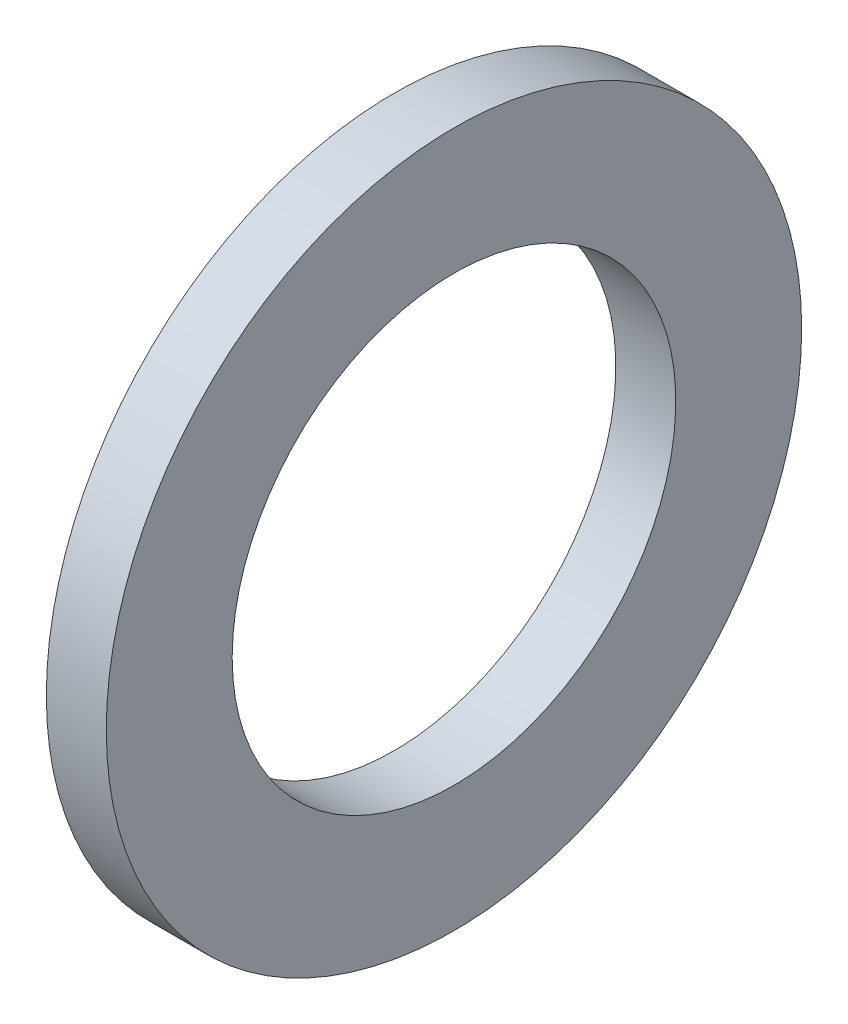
ISO-10303-21;
HEADER;
FILE_DESCRIPTION(('STEP AP214'),'2;1');
FILE_NAME('part.step','',(''),(''),'','','');
FILE_SCHEMA(('AUTOMOTIVE_DESIGN { 1 0 10303 214 1 1 1 1 }'));
ENDSEC;
DATA;
#1=APPLICATION_CONTEXT('core data for automotive mechanical design processes');
#2=APPLICATION_PROTOCOL_DEFINITION('international standard','automotive_design',2000,#1);
#3=PRODUCT_CONTEXT('',#1,'mechanical');
#4=PRODUCT('Part','Part','',(#3));
#5=PRODUCT_RELATED_PRODUCT_CATEGORY('part','',(#4));
#6=PRODUCT_DEFINITION_FORMATION('','',#4);
#7=PRODUCT_DEFINITION_CONTEXT('part definition',#1,'design');
#8=PRODUCT_DEFINITION('design','',#6,#7);
#9=PRODUCT_DEFINITION_SHAPE('','',#8);
#10=(LENGTH_UNIT() NAMED_UNIT(*) SI_UNIT(.MILLI.,.METRE.));
#11=(NAMED_UNIT(*) PLANE_ANGLE_UNIT() SI_UNIT($,.RADIAN.));
#12=(NAMED_UNIT(*) SI_UNIT($,.STERADIAN.) SOLID_ANGLE_UNIT());
#13=UNCERTAINTY_MEASURE_WITH_UNIT(LENGTH_MEASURE(1.E-05),#10,'distance_accuracy_value','');
#14=(GEOMETRIC_REPRESENTATION_CONTEXT(3) GLOBAL_UNCERTAINTY_ASSIGNED_CONTEXT((#13)) GLOBAL_UNIT_ASSIGNED_CONTEXT((#10,
#11,#12)) REPRESENTATION_CONTEXT('',''));
#15=CARTESIAN_POINT('',(0.,0.,0.));
#16=DIRECTION('',(0.,0.,1.));
#17=DIRECTION('',(1.,0.,0.));
#18=AXIS2_PLACEMENT_3D('',#15,#16,#17);
#19=CARTESIAN_POINT('',(-34.9249999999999,0.,0.));
#20=DIRECTION('',(-1.,0.,0.));
#21=DIRECTION('',(0.,0.,1.));
#22=AXIS2_PLACEMENT_3D('',#19,#20,#21);
#23=CYLINDRICAL_SURFACE('',#22,18.5);
#24=CARTESIAN_POINT('',(0.,0.,0.));
#25=DIRECTION('',(-1.,0.,0.));
#26=DIRECTION('',(0.,0.,1.));
#27=AXIS2_PLACEMENT_3D('',#24,#25,#26);
#28=CIRCLE('',#27,18.5);
#29=CARTESIAN_POINT('',(0.,0.,18.5));
#30=VERTEX_POINT('',#29);
#31=EDGE_CURVE('E10',#30,#30,#28,.T.);
#32=ORIENTED_EDGE('',*,*,#31,.F.);
#33=EDGE_LOOP('',(#32));
#34=FACE_BOUND('',#33,.T.);
#35=CARTESIAN_POINT('',(-5.,0.,0.));
#36=DIRECTION('',(-1.,0.,0.));
#37=DIRECTION('',(0.,0.,1.));
#38=AXIS2_PLACEMENT_3D('',#35,#36,#37);
#39=CIRCLE('',#38,18.5);
#40=CARTESIAN_POINT('',(-5.,0.,18.5));
#41=VERTEX_POINT('',#40);
#42=EDGE_CURVE('E45',#41,#41,#39,.T.);
#43=ORIENTED_EDGE('',*,*,#42,.T.);
#44=EDGE_LOOP('',(#43));
#45=FACE_BOUND('',#44,.T.);
#46=ADVANCED_FACE('F31',(#34,#45),#23,.F.);
#47=CARTESIAN_POINT('',(0.,18.5,0.));
#48=DIRECTION('',(-1.,0.,0.));
#49=DIRECTION('',(0.,0.,1.));
#50=AXIS2_PLACEMENT_3D('',#47,#48,#49);
#51=PLANE('',#50);
#52=CARTESIAN_POINT('',(0.,0.,0.));
#53=DIRECTION('',(-1.,0.,0.));
#54=DIRECTION('',(0.,0.,1.));
#55=AXIS2_PLACEMENT_3D('',#52,#53,#54);
#56=CIRCLE('',#55,29.);
#57=CARTESIAN_POINT('',(0.,0.,29.));
#58=VERTEX_POINT('',#57);
#59=EDGE_CURVE('E37',#58,#58,#56,.T.);
#60=ORIENTED_EDGE('',*,*,#59,.F.);
#61=EDGE_LOOP('',(#60));
#62=FACE_BOUND('',#61,.T.);
#63=ORIENTED_EDGE('',*,*,#31,.T.);
#64=EDGE_LOOP('',(#63));
#65=FACE_BOUND('',#64,.T.);
#66=ADVANCED_FACE('F60',(#62,#65),#51,.F.);
#67=CARTESIAN_POINT('',(-34.9249999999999,0.,0.));
#68=DIRECTION('',(-1.,0.,0.));
#69=DIRECTION('',(0.,0.,1.));
#70=AXIS2_PLACEMENT_3D('',#67,#68,#69);
#71=CYLINDRICAL_SURFACE('',#70,29.);
#72=CARTESIAN_POINT('',(-5.,0.,0.));
#73=DIRECTION('',(-1.,0.,0.));
#74=DIRECTION('',(0.,0.,1.));
#75=AXIS2_PLACEMENT_3D('',#72,#73,#74);
#76=CIRCLE('',#75,29.);
#77=CARTESIAN_POINT('',(-5.,0.,29.));
#78=VERTEX_POINT('',#77);
#79=EDGE_CURVE('E41',#78,#78,#76,.T.);
#80=ORIENTED_EDGE('',*,*,#79,.F.);
#81=EDGE_LOOP('',(#80));
#82=FACE_BOUND('',#81,.T.);
#83=ORIENTED_EDGE('',*,*,#59,.T.);
#84=EDGE_LOOP('',(#83));
#85=FACE_BOUND('',#84,.T.);
#86=ADVANCED_FACE('F55',(#82,#85),#71,.T.);
#87=CARTESIAN_POINT('',(-5.,29.,0.));
#88=DIRECTION('',(1.,0.,0.));
#89=DIRECTION('',(0.,0.,-1.));
#90=AXIS2_PLACEMENT_3D('',#87,#88,#89);
#91=PLANE('',#90);
#92=ORIENTED_EDGE('',*,*,#42,.F.);
#93=EDGE_LOOP('',(#92));
#94=FACE_BOUND('',#93,.T.);
#95=ORIENTED_EDGE('',*,*,#79,.T.);
#96=EDGE_LOOP('',(#95));
#97=FACE_BOUND('',#96,.T.);
#98=ADVANCED_FACE('F52',(#94,#97),#91,.F.);
#99=CLOSED_SHELL('',(#46,#66,#86,#98));
#100=MANIFOLD_SOLID_BREP('B2',#99);
#101=ADVANCED_BREP_SHAPE_REPRESENTATION('',(#18,#100),#14);
#102=SHAPE_DEFINITION_REPRESENTATION(#9,#101);
ENDSEC;
END-ISO-10303-21;
